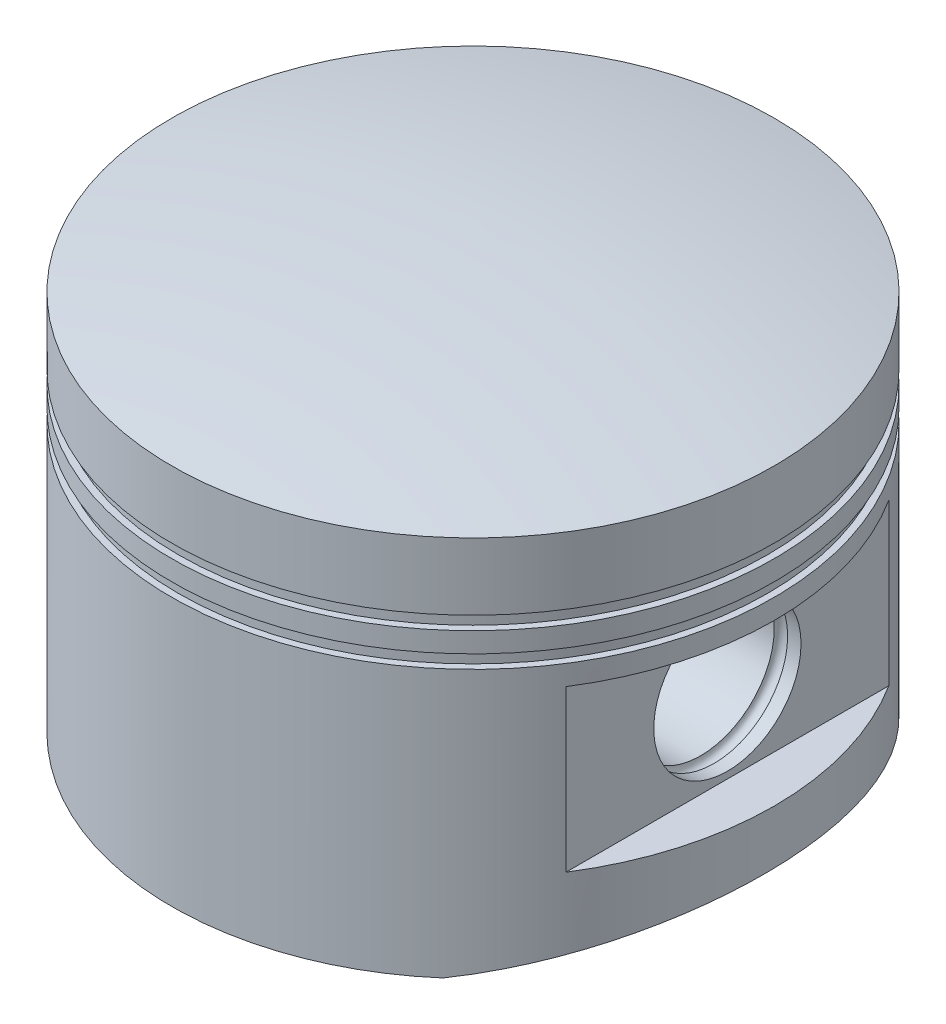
from build123d import *

# Parameters (mm, degrees)
SKETCH2_W           = 14
SKETCH2_H           = 24
CUT_EXTRUDE1_DEPTH  = 85
BOSS_EXTRUDE1_REACH = 81.114
BOSS_EXTRUDE2_DEPTH = 10
SKETCH5_R           = 11
CUT_EXTRUDE2_DEPTH  = 108
FILLET1_R           = 2
DOME1_FACE_RADIUS   = 45
DOME1_HEIGHT        = 5
SKETCH6_R           = 140
CUT_EXTRUDE3_DEPTH  = 54
SKETCH7_R           = 1


with BuildPart() as part:
    # Sketch1 → Revolve2 (revolve)
    with BuildSketch(Plane.XY, mode=Mode.PRIVATE) as revolve2_sk:
        Polygon((0, 22.610206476), (0, 30.610206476), (45, 30.610206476), (45, 20.610206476), (44, 20.610206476), (44, 18.610206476), (45, 18.610206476), (45, 15.610206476), (44, 15.610206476), (44, 13.610206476), (45, 13.610206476), (45, -26.389793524), (42, -26.389793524), (42, -16.389793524), (37, -16.389793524), (37, 22.610206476), (22.987943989, 22.610206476), align=None)
    revolve(revolve2_sk.sketch.rotate(Axis((0, 22.610206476, 0), (0, 1, 0)), 90), axis=Axis((0, 22.610206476, 0), (0, 1, 0)))

    # Sketch2 → Cut-Extrude1 (cut, symmetric)
    with BuildSketch(Plane.XY):
        with Locations((45, -1.389793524)):
            Rectangle(SKETCH2_W, SKETCH2_H)
        with Locations((-45, -1.389793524)):
            Rectangle(SKETCH2_W, SKETCH2_H)
    extrude(amount=CUT_EXTRUDE1_DEPTH, both=True, mode=Mode.SUBTRACT)

    # Sketch3 → Boss-Extrude1 (add, up to next)
    with BuildSketch(Plane.XZ.offset(16.389793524), mode=Mode.PRIVATE) as boss_extrude1_sk1:
        with BuildLine():
            Line((30, 21.656407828), (30, -21.656407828))
            ThreePointArc((30, -21.656407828), (37, 0), (30, 21.656407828))
        make_face()
    boss_extrude1_tool1 = extrude(boss_extrude1_sk1.sketch, amount=-BOSS_EXTRUDE1_REACH, mode=Mode.PRIVATE) - part.part
    # Sketch3 → Boss-Extrude1 (add, up to next)
    with BuildSketch(Plane.XZ.offset(16.389793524), mode=Mode.PRIVATE) as boss_extrude1_sk2:
        with BuildLine():
            Line((-30, 21.656407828), (-30, -21.656407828))
            ThreePointArc((-30, -21.656407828), (-37, 0), (-30, 21.656407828))
        make_face()
    boss_extrude1_tool2 = extrude(boss_extrude1_sk2.sketch, amount=-BOSS_EXTRUDE1_REACH, mode=Mode.PRIVATE) - part.part
    add(boss_extrude1_tool1.solids().sort_by_distance((32.824021, -16.389794, 0))[0])
    add(boss_extrude1_tool2.solids().sort_by_distance((-32.824021, -16.389794, 0))[0])

    # Sketch4 → Boss-Extrude2 (add)
    with BuildSketch(Plane(origin=(-30, 0, 0), x_dir=(0, 0, -1), z_dir=(1, 0, 0))):
        with BuildLine():
            Line((-16.389793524, 0), (-16.389793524, 22.610206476))
            Line((-16.389793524, 22.610206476), (16.389793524, 22.610206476))
            Line((16.389793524, 22.610206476), (16.389793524, 0))
            ThreePointArc((16.389793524, 0), (0, -16.389793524), (-16.389793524, 0))
        make_face()
    boss_extrude2 = extrude(amount=BOSS_EXTRUDE2_DEPTH)

    # Mirror1: Boss-Extrude2 across plane
    add(boss_extrude2.mirror(Plane(origin=(0, 0, 0), x_dir=(0, 0, 1), z_dir=(1, 0, 0))))

    # Sketch5 → Cut-Extrude2 (cut)
    with BuildSketch(Plane(origin=(38, 0, 0), x_dir=(0, 0, -1), z_dir=(1, 0, 0))):
        with Locations((0, -1.389793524)):
            Circle(SKETCH5_R)
    extrude(amount=-CUT_EXTRUDE2_DEPTH, mode=Mode.SUBTRACT)

    # Fillet1
    fillet1_edges = [part.edges().sort_by_distance(p)[0] for p in [
        (20, -16.389793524, 0),
        (20, 11.305103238, 16.389793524),
        (20, 11.305103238, -16.389793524),
        (-20, -16.389793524, 0),
        (-20, 11.305103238, -16.389793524),
        (-20, 11.305103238, 16.389793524),
    ]]
    fillet(fillet1_edges, radius=FILLET1_R)

    # Dome1: a dome of height H over a round flat face of radius A is a cap of a sphere of radius (A * A + H * H) / (2 * H)
    dome1_r = (DOME1_FACE_RADIUS * DOME1_FACE_RADIUS + DOME1_HEIGHT * DOME1_HEIGHT) / (2 * DOME1_HEIGHT)
    dome1_base = Plane((0, 30.610206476, 0), z_dir=(0, 1, 0))
    with Locations(dome1_base.offset(DOME1_HEIGHT - dome1_r)):
        dome1_ball = Sphere(dome1_r, mode=Mode.PRIVATE)
    add(split(dome1_ball, bisect_by=dome1_base, keep=Keep.TOP, mode=Mode.PRIVATE))

    # Sketch6 → Cut-Extrude3 (cut, symmetric)
    with BuildSketch(Plane(origin=(0, 0, 0), x_dir=(0, 0, -1), z_dir=(1, 0, 0))):
        with Locations((3.098167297, -161.389793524)):
            Circle(SKETCH6_R)
    extrude(amount=CUT_EXTRUDE3_DEPTH, both=True, mode=Mode.SUBTRACT)

    # Sketch7 → Cut-Revolve1 (revolve, cut)
    with BuildSketch(Plane.XY, mode=Mode.PRIVATE) as cut_revolve1_sk:
        with Locations((-35, 9.610206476)):
            Circle(SKETCH7_R)
        with Locations((35, 9.610206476)):
            Circle(SKETCH7_R)
    revolve(cut_revolve1_sk.sketch.rotate(Axis((-47.468523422, -1.389793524, 0), (1, 0, 0)), 270), axis=Axis((-47.468523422, -1.389793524, 0), (1, 0, 0)), mode=Mode.SUBTRACT)


solid = part.part
